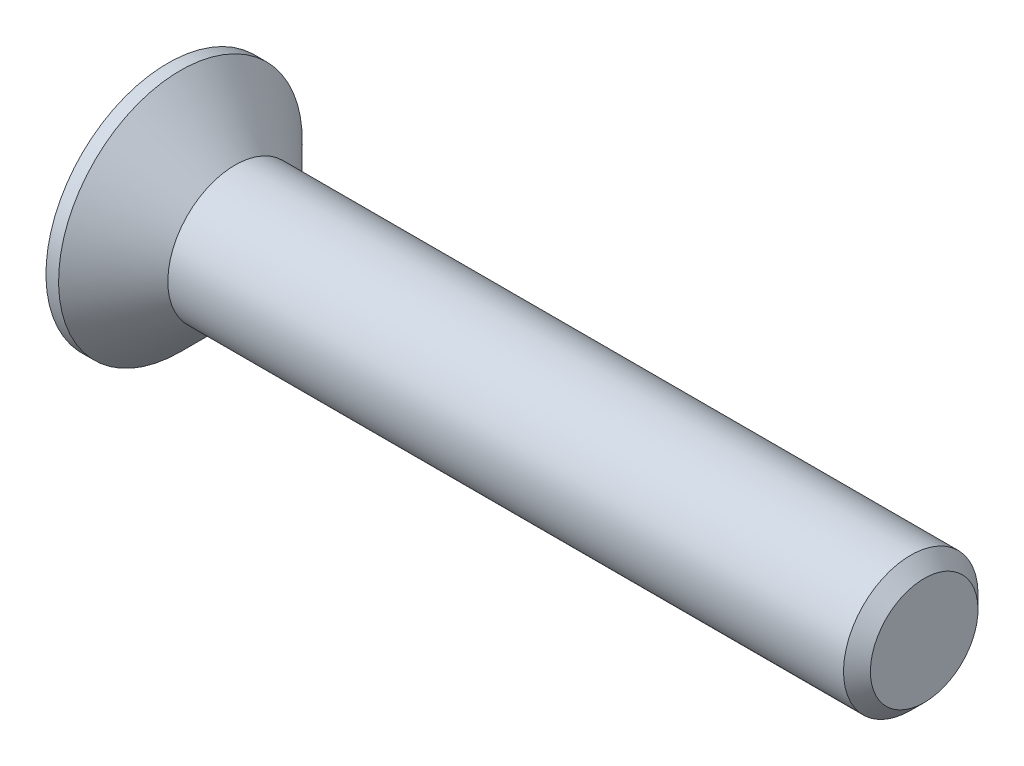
from build123d import *

# Parameters (mm, degrees)
CHAMFER1_SIZE      = 0.8
CUT_EXTRUDE1_DEPTH = 3.45


with BuildPart() as part:
    # Sketch1 → Revolve1 (revolve)
    with BuildSketch(Plane.XY, mode=Mode.PRIVATE) as revolve1_sk:
        Polygon((-4, 7.25), (-4, 0), (41, 0), (41, 4), (0, 4), (-3.25, 7.25), align=None)
    revolve(revolve1_sk.sketch.rotate(Axis((-4, 0, 0), (1, 0, 0)), 180), axis=Axis((-4, 0, 0), (1, 0, 0)))

    # Chamfer1
    chamfer1_edges = [part.edges().sort_by_distance(p)[0] for p in [
        (41, 4, 0),
    ]]
    chamfer(chamfer1_edges, length=CHAMFER1_SIZE)

    # Sketch2 → Cut-Extrude1 (cut)
    with BuildSketch(Plane.ZY.offset(4)):
        Polygon((-1.09, 4.35), (1.09, 4.35), (1.09, 1.09), (4.35, 1.09), (4.35, -1.09), (1.09, -1.09), (1.09, -4.35), (-1.09, -4.35), (-1.09, -1.09), (-4.35, -1.09), (-4.35, 1.09), (-1.09, 1.09), align=None)
    extrude(amount=-CUT_EXTRUDE1_DEPTH, mode=Mode.SUBTRACT)


solid = part.part
